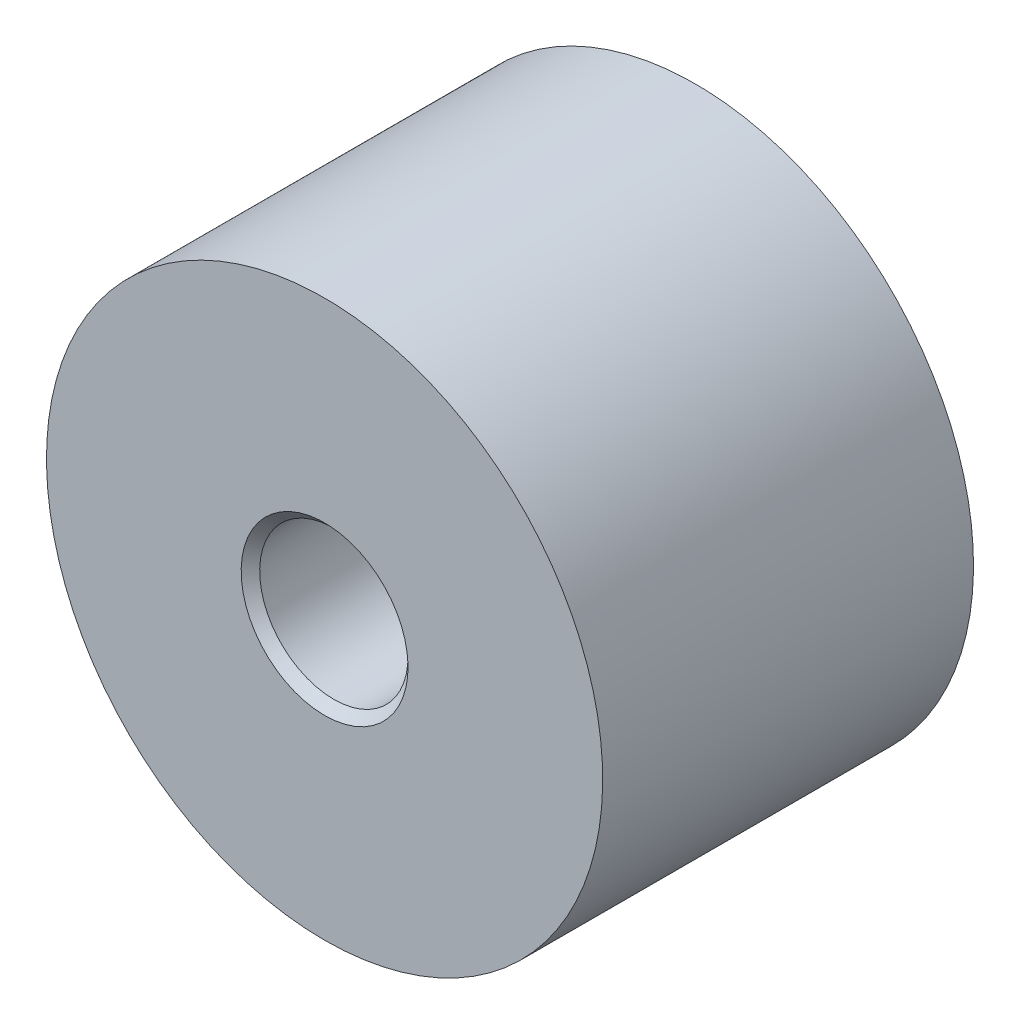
ISO-10303-21;
HEADER;
FILE_DESCRIPTION(('STEP AP214'),'2;1');
FILE_NAME('part.step','',(''),(''),'','','');
FILE_SCHEMA(('AUTOMOTIVE_DESIGN { 1 0 10303 214 1 1 1 1 }'));
ENDSEC;
DATA;
#1=APPLICATION_CONTEXT('core data for automotive mechanical design processes');
#2=APPLICATION_PROTOCOL_DEFINITION('international standard','automotive_design',2000,#1);
#3=PRODUCT_CONTEXT('',#1,'mechanical');
#4=PRODUCT('Part','Part','',(#3));
#5=PRODUCT_RELATED_PRODUCT_CATEGORY('part','',(#4));
#6=PRODUCT_DEFINITION_FORMATION('','',#4);
#7=PRODUCT_DEFINITION_CONTEXT('part definition',#1,'design');
#8=PRODUCT_DEFINITION('design','',#6,#7);
#9=PRODUCT_DEFINITION_SHAPE('','',#8);
#10=(LENGTH_UNIT() NAMED_UNIT(*) SI_UNIT(.MILLI.,.METRE.));
#11=(NAMED_UNIT(*) PLANE_ANGLE_UNIT() SI_UNIT($,.RADIAN.));
#12=(NAMED_UNIT(*) SI_UNIT($,.STERADIAN.) SOLID_ANGLE_UNIT());
#13=UNCERTAINTY_MEASURE_WITH_UNIT(LENGTH_MEASURE(1.E-05),#10,'distance_accuracy_value','');
#14=(GEOMETRIC_REPRESENTATION_CONTEXT(3) GLOBAL_UNCERTAINTY_ASSIGNED_CONTEXT((#13)) GLOBAL_UNIT_ASSIGNED_CONTEXT((#10,
#11,#12)) REPRESENTATION_CONTEXT('',''));
#15=CARTESIAN_POINT('',(0.,0.,0.));
#16=DIRECTION('',(0.,0.,1.));
#17=DIRECTION('',(1.,0.,0.));
#18=AXIS2_PLACEMENT_3D('',#15,#16,#17);
#19=CARTESIAN_POINT('',(14.,0.,20.));
#20=DIRECTION('',(0.,0.,1.));
#21=DIRECTION('',(0.,-1.,0.));
#22=AXIS2_PLACEMENT_3D('',#19,#20,#21);
#23=PLANE('',#22);
#24=CARTESIAN_POINT('',(0.,0.,20.));
#25=DIRECTION('',(0.,0.,1.));
#26=DIRECTION('',(0.,-1.,0.));
#27=AXIS2_PLACEMENT_3D('',#24,#25,#26);
#28=CIRCLE('',#27,4.5);
#29=CARTESIAN_POINT('',(0.,-4.5,20.));
#30=VERTEX_POINT('',#29);
#31=EDGE_CURVE('E8',#30,#30,#28,.F.);
#32=ORIENTED_EDGE('',*,*,#31,.T.);
#33=EDGE_LOOP('',(#32));
#34=FACE_BOUND('',#33,.T.);
#35=CARTESIAN_POINT('',(0.,0.,20.));
#36=DIRECTION('',(0.,0.,1.));
#37=DIRECTION('',(0.,-1.,0.));
#38=AXIS2_PLACEMENT_3D('',#35,#36,#37);
#39=CIRCLE('',#38,15.);
#40=CARTESIAN_POINT('',(0.,-15.,20.));
#41=VERTEX_POINT('',#40);
#42=EDGE_CURVE('E32',#41,#41,#39,.T.);
#43=ORIENTED_EDGE('',*,*,#42,.T.);
#44=EDGE_LOOP('',(#43));
#45=FACE_BOUND('',#44,.T.);
#46=ADVANCED_FACE('F12',(#34,#45),#23,.T.);
#47=CARTESIAN_POINT('',(0.,0.,0.66666666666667));
#48=DIRECTION('',(0.,0.,1.));
#49=DIRECTION('',(0.,-1.,0.));
#50=AXIS2_PLACEMENT_3D('',#47,#48,#49);
#51=CYLINDRICAL_SURFACE('',#50,15.);
#52=CARTESIAN_POINT('',(0.,0.,0.));
#53=DIRECTION('',(0.,0.,1.));
#54=DIRECTION('',(0.,-1.,0.));
#55=AXIS2_PLACEMENT_3D('',#52,#53,#54);
#56=CIRCLE('',#55,15.);
#57=CARTESIAN_POINT('',(0.,-15.,0.));
#58=VERTEX_POINT('',#57);
#59=EDGE_CURVE('E35',#58,#58,#56,.T.);
#60=ORIENTED_EDGE('',*,*,#59,.T.);
#61=EDGE_LOOP('',(#60));
#62=FACE_BOUND('',#61,.T.);
#63=ORIENTED_EDGE('',*,*,#42,.F.);
#64=EDGE_LOOP('',(#63));
#65=FACE_BOUND('',#64,.T.);
#66=ADVANCED_FACE('F63',(#62,#65),#51,.T.);
#67=CARTESIAN_POINT('',(15.,0.,0.));
#68=DIRECTION('',(0.,0.,-1.));
#69=DIRECTION('',(0.,1.,0.));
#70=AXIS2_PLACEMENT_3D('',#67,#68,#69);
#71=PLANE('',#70);
#72=CARTESIAN_POINT('',(0.,0.,0.));
#73=DIRECTION('',(0.,0.,-1.));
#74=DIRECTION('',(0.,1.,0.));
#75=AXIS2_PLACEMENT_3D('',#72,#73,#74);
#76=CIRCLE('',#75,4.5);
#77=CARTESIAN_POINT('',(0.,4.5,0.));
#78=VERTEX_POINT('',#77);
#79=EDGE_CURVE('E23',#78,#78,#76,.F.);
#80=ORIENTED_EDGE('',*,*,#79,.T.);
#81=EDGE_LOOP('',(#80));
#82=FACE_BOUND('',#81,.T.);
#83=ORIENTED_EDGE('',*,*,#59,.F.);
#84=EDGE_LOOP('',(#83));
#85=FACE_BOUND('',#84,.T.);
#86=ADVANCED_FACE('F68',(#82,#85),#71,.T.);
#87=CARTESIAN_POINT('',(0.,0.,0.));
#88=DIRECTION('',(0.,0.,1.));
#89=DIRECTION('',(0.,-1.,0.));
#90=AXIS2_PLACEMENT_3D('',#87,#88,#89);
#91=CYLINDRICAL_SURFACE('',#90,4.);
#92=CARTESIAN_POINT('',(0.,0.,0.5));
#93=DIRECTION('',(0.,0.,-1.));
#94=DIRECTION('',(0.,1.,0.));
#95=AXIS2_PLACEMENT_3D('',#92,#93,#94);
#96=CIRCLE('',#95,4.);
#97=CARTESIAN_POINT('',(0.,4.,0.5));
#98=VERTEX_POINT('',#97);
#99=EDGE_CURVE('E27',#98,#98,#96,.T.);
#100=ORIENTED_EDGE('',*,*,#99,.T.);
#101=EDGE_LOOP('',(#100));
#102=FACE_BOUND('',#101,.T.);
#103=CARTESIAN_POINT('',(0.,0.,8.));
#104=DIRECTION('',(0.,0.,-1.));
#105=DIRECTION('',(0.,1.,0.));
#106=AXIS2_PLACEMENT_3D('',#103,#104,#105);
#107=CIRCLE('',#106,4.);
#108=CARTESIAN_POINT('',(0.,4.,8.));
#109=VERTEX_POINT('',#108);
#110=EDGE_CURVE('E38',#109,#109,#107,.T.);
#111=ORIENTED_EDGE('',*,*,#110,.F.);
#112=EDGE_LOOP('',(#111));
#113=FACE_BOUND('',#112,.T.);
#114=ADVANCED_FACE('F58',(#102,#113),#91,.F.);
#115=CARTESIAN_POINT('',(0.,0.,8.));
#116=DIRECTION('',(0.,0.,-1.));
#117=DIRECTION('',(0.,1.,0.));
#118=AXIS2_PLACEMENT_3D('',#115,#116,#117);
#119=PLANE('',#118);
#120=ORIENTED_EDGE('',*,*,#110,.T.);
#121=EDGE_LOOP('',(#120));
#122=FACE_BOUND('',#121,.T.);
#123=ADVANCED_FACE('F49',(#122),#119,.T.);
#124=CARTESIAN_POINT('',(0.,0.,14.666666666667));
#125=DIRECTION('',(0.,0.,1.));
#126=DIRECTION('',(0.,-1.,0.));
#127=AXIS2_PLACEMENT_3D('',#124,#125,#126);
#128=CYLINDRICAL_SURFACE('',#127,4.);
#129=CARTESIAN_POINT('',(0.,0.,19.5));
#130=DIRECTION('',(0.,0.,1.));
#131=DIRECTION('',(0.,-1.,0.));
#132=AXIS2_PLACEMENT_3D('',#129,#130,#131);
#133=CIRCLE('',#132,4.);
#134=CARTESIAN_POINT('',(0.,-4.,19.5));
#135=VERTEX_POINT('',#134);
#136=EDGE_CURVE('E19',#135,#135,#133,.T.);
#137=ORIENTED_EDGE('',*,*,#136,.T.);
#138=EDGE_LOOP('',(#137));
#139=FACE_BOUND('',#138,.T.);
#140=CARTESIAN_POINT('',(0.,0.,12.));
#141=DIRECTION('',(0.,0.,1.));
#142=DIRECTION('',(0.,-1.,0.));
#143=AXIS2_PLACEMENT_3D('',#140,#141,#142);
#144=CIRCLE('',#143,4.);
#145=CARTESIAN_POINT('',(0.,-4.,12.));
#146=VERTEX_POINT('',#145);
#147=EDGE_CURVE('E41',#146,#146,#144,.T.);
#148=ORIENTED_EDGE('',*,*,#147,.F.);
#149=EDGE_LOOP('',(#148));
#150=FACE_BOUND('',#149,.T.);
#151=ADVANCED_FACE('F47',(#139,#150),#128,.F.);
#152=CARTESIAN_POINT('',(0.,0.,12.));
#153=DIRECTION('',(0.,0.,1.));
#154=DIRECTION('',(0.,-1.,0.));
#155=AXIS2_PLACEMENT_3D('',#152,#153,#154);
#156=PLANE('',#155);
#157=ORIENTED_EDGE('',*,*,#147,.T.);
#158=EDGE_LOOP('',(#157));
#159=FACE_BOUND('',#158,.T.);
#160=ADVANCED_FACE('F45',(#159),#156,.T.);
#161=CARTESIAN_POINT('',(0.,0.,0.5));
#162=DIRECTION('',(0.,0.,-1.));
#163=DIRECTION('',(0.,1.,0.));
#164=AXIS2_PLACEMENT_3D('',#161,#162,#163);
#165=CONICAL_SURFACE('',#164,4.,0.785398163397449);
#166=ORIENTED_EDGE('',*,*,#79,.F.);
#167=EDGE_LOOP('',(#166));
#168=FACE_BOUND('',#167,.T.);
#169=ORIENTED_EDGE('',*,*,#99,.F.);
#170=EDGE_LOOP('',(#169));
#171=FACE_BOUND('',#170,.T.);
#172=ADVANCED_FACE('F56',(#168,#171),#165,.F.);
#173=CARTESIAN_POINT('',(0.,0.,19.5));
#174=DIRECTION('',(0.,0.,1.));
#175=DIRECTION('',(0.,-1.,0.));
#176=AXIS2_PLACEMENT_3D('',#173,#174,#175);
#177=CONICAL_SURFACE('',#176,4.,0.785398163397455);
#178=ORIENTED_EDGE('',*,*,#31,.F.);
#179=EDGE_LOOP('',(#178));
#180=FACE_BOUND('',#179,.T.);
#181=ORIENTED_EDGE('',*,*,#136,.F.);
#182=EDGE_LOOP('',(#181));
#183=FACE_BOUND('',#182,.T.);
#184=ADVANCED_FACE('F14',(#180,#183),#177,.F.);
#185=CLOSED_SHELL('',(#46,#66,#86,#114,#123,#151,#160,#172,#184));
#186=MANIFOLD_SOLID_BREP('B1',#185);
#187=ADVANCED_BREP_SHAPE_REPRESENTATION('',(#18,#186),#14);
#188=SHAPE_DEFINITION_REPRESENTATION(#9,#187);
ENDSEC;
END-ISO-10303-21;
